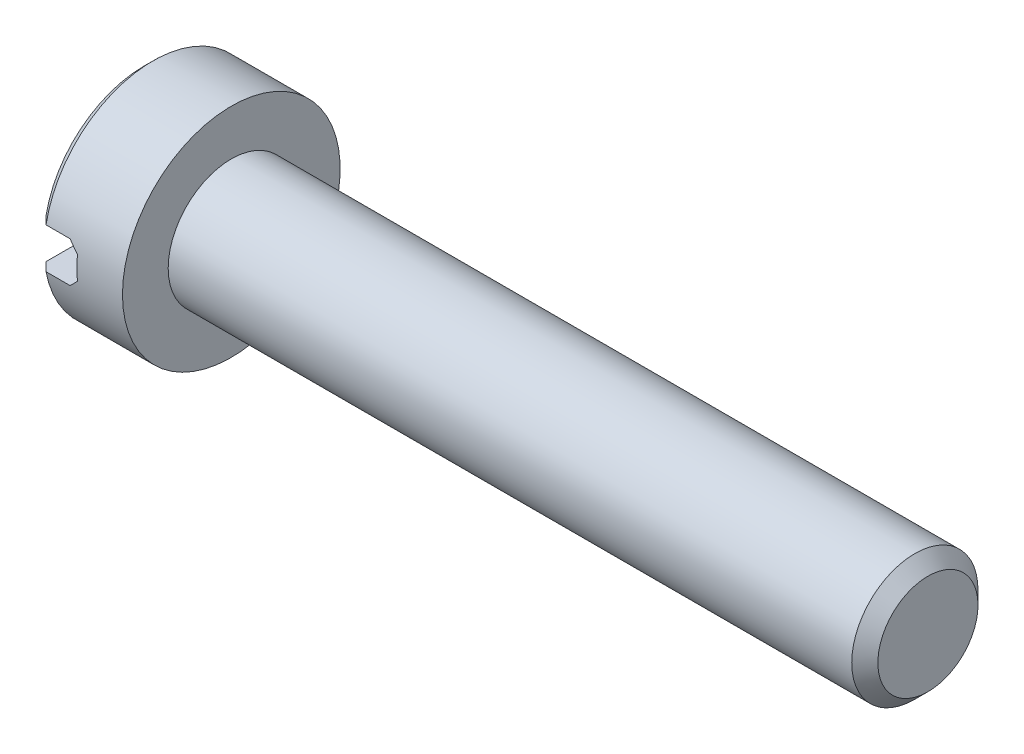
from build123d import *

# Parameters (mm, degrees)
ENL_V_MAT_EXTRU_1_DEPTH = 5
ESQUISSE3_R             = 1.45
EXTRUSION1_DEPTH        = 16
CHANFREIN1_SIZE         = 0.3


with BuildPart() as part:
    # Esquisse1 → R_volution1 (revolve)
    with BuildSketch(Plane.XY, mode=Mode.PRIVATE) as r_volution1_sk:
        Polygon((0, 0), (0, 2.3), (0.2, 2.5), (2, 2.5), (2, 0), align=None)
    revolve(r_volution1_sk.sketch.rotate(Axis((0, 0, 0), (1, 0, 0)), 90), axis=Axis((0, 0, 0), (1, 0, 0)))

    # Esquisse2 → Enl_v. mat.-Extru.1 (cut, symmetric)
    with BuildSketch(Plane.XY):
        Polygon((0, 0.465549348), (0.753445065, 0.465549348), (0.953445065, 0.265549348), (0.953445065, -0.265549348), (0.753445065, -0.465549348), (0, -0.465549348), align=None)
    extrude(amount=ENL_V_MAT_EXTRU_1_DEPTH, both=True, mode=Mode.SUBTRACT)

    # Esquisse3 → Extrusion1 (add)
    with BuildSketch(Plane(origin=(2, 0, 0), x_dir=(0, 0, -1), z_dir=(1, 0, 0))):
        with Locations(Location((0, 0, 0), (0, 0, 180))):
            Circle(ESQUISSE3_R)
    extrude(amount=EXTRUSION1_DEPTH)

    # Chanfrein1
    chanfrein1_edges = [part.edges().sort_by_distance(p)[0] for p in [
        (18, 0, -1.45),
    ]]
    chamfer(chanfrein1_edges, length=CHANFREIN1_SIZE)


solid = part.part
